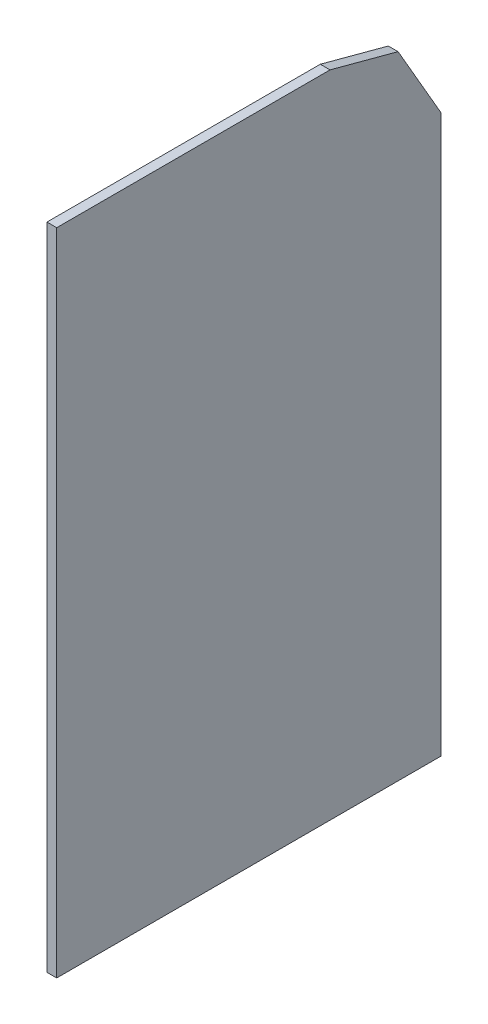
ISO-10303-21;
HEADER;
FILE_DESCRIPTION(('STEP AP214'),'2;1');
FILE_NAME('part.step','',(''),(''),'','','');
FILE_SCHEMA(('AUTOMOTIVE_DESIGN { 1 0 10303 214 1 1 1 1 }'));
ENDSEC;
DATA;
#1=APPLICATION_CONTEXT('core data for automotive mechanical design processes');
#2=APPLICATION_PROTOCOL_DEFINITION('international standard','automotive_design',2000,#1);
#3=PRODUCT_CONTEXT('',#1,'mechanical');
#4=PRODUCT('Part','Part','',(#3));
#5=PRODUCT_RELATED_PRODUCT_CATEGORY('part','',(#4));
#6=PRODUCT_DEFINITION_FORMATION('','',#4);
#7=PRODUCT_DEFINITION_CONTEXT('part definition',#1,'design');
#8=PRODUCT_DEFINITION('design','',#6,#7);
#9=PRODUCT_DEFINITION_SHAPE('','',#8);
#10=(LENGTH_UNIT() NAMED_UNIT(*) SI_UNIT(.MILLI.,.METRE.));
#11=(NAMED_UNIT(*) PLANE_ANGLE_UNIT() SI_UNIT($,.RADIAN.));
#12=(NAMED_UNIT(*) SI_UNIT($,.STERADIAN.) SOLID_ANGLE_UNIT());
#13=UNCERTAINTY_MEASURE_WITH_UNIT(LENGTH_MEASURE(1.E-05),#10,'distance_accuracy_value','');
#14=(GEOMETRIC_REPRESENTATION_CONTEXT(3) GLOBAL_UNCERTAINTY_ASSIGNED_CONTEXT((#13)) GLOBAL_UNIT_ASSIGNED_CONTEXT((#10,
#11,#12)) REPRESENTATION_CONTEXT('',''));
#15=CARTESIAN_POINT('',(0.,0.,0.));
#16=DIRECTION('',(0.,0.,1.));
#17=DIRECTION('',(1.,0.,0.));
#18=AXIS2_PLACEMENT_3D('',#15,#16,#17);
#19=CARTESIAN_POINT('',(38.1000000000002,5101.6125,1500.));
#20=DIRECTION('',(-1.,0.,0.));
#21=DIRECTION('',(0.,0.,1.));
#22=AXIS2_PLACEMENT_3D('',#19,#20,#21);
#23=PLANE('',#22);
#24=DIRECTION('',(0.,-0.258819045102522,-0.965925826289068));
#25=VECTOR('',#24,1.);
#26=CARTESIAN_POINT('',(38.1000000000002,4959.30710999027,-1164.48593996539));
#27=LINE('',#26,#25);
#28=CARTESIAN_POINT('',(38.1000000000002,5101.6125,-633.394994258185));
#29=VERTEX_POINT('',#28);
#30=CARTESIAN_POINT('',(38.0999999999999,4959.30710999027,-1164.48593996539));
#31=VERTEX_POINT('',#30);
#32=EDGE_CURVE('E708',#29,#31,#27,.T.);
#33=ORIENTED_EDGE('',*,*,#32,.F.);
#34=DIRECTION('',(0.,0.,-1.));
#35=VECTOR('',#34,1.);
#36=CARTESIAN_POINT('',(38.1000000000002,5101.6125,1500.));
#37=LINE('',#36,#35);
#38=CARTESIAN_POINT('',(38.1000000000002,5101.6125,1500.));
#39=VERTEX_POINT('',#38);
#40=EDGE_CURVE('E818',#39,#29,#37,.T.);
#41=ORIENTED_EDGE('',*,*,#40,.F.);
#42=DIRECTION('',(0.,-1.,0.));
#43=VECTOR('',#42,1.);
#44=CARTESIAN_POINT('',(38.1000000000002,5101.6125,1500.));
#45=LINE('',#44,#43);
#46=CARTESIAN_POINT('',(38.1000000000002,30.0000000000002,1500.));
#47=VERTEX_POINT('',#46);
#48=EDGE_CURVE('E822',#39,#47,#45,.T.);
#49=ORIENTED_EDGE('',*,*,#48,.T.);
#50=DIRECTION('',(0.,0.,-1.));
#51=VECTOR('',#50,1.);
#52=CARTESIAN_POINT('',(38.1000000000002,30.0000000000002,1500.));
#53=LINE('',#52,#51);
#54=CARTESIAN_POINT('',(38.0999999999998,30.0000000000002,-1500.));
#55=VERTEX_POINT('',#54);
#56=EDGE_CURVE('E848',#47,#55,#53,.T.);
#57=ORIENTED_EDGE('',*,*,#56,.T.);
#58=DIRECTION('',(0.,-1.,0.));
#59=VECTOR('',#58,1.);
#60=CARTESIAN_POINT('',(38.0999999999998,5101.6125,-1500.));
#61=LINE('',#60,#59);
#62=CARTESIAN_POINT('',(38.1000000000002,4380.42971135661,-1500.));
#63=VERTEX_POINT('',#62);
#64=EDGE_CURVE('E789',#63,#55,#61,.T.);
#65=ORIENTED_EDGE('',*,*,#64,.F.);
#66=DIRECTION('',(0.,0.,-1.));
#67=VECTOR('',#66,1.);
#68=CARTESIAN_POINT('',(38.1000000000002,4380.42971135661,-1498.70096189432));
#69=LINE('',#68,#67);
#70=CARTESIAN_POINT('',(38.1000000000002,4380.42971135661,-1498.70096189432));
#71=VERTEX_POINT('',#70);
#72=EDGE_CURVE('E768',#71,#63,#69,.T.);
#73=ORIENTED_EDGE('',*,*,#72,.F.);
#74=DIRECTION('',(0.,-0.86602540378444,-0.499999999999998));
#75=VECTOR('',#74,1.);
#76=CARTESIAN_POINT('',(38.1000000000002,4380.42971135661,-1498.70096189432));
#77=LINE('',#76,#75);
#78=EDGE_CURVE('E778',#31,#71,#77,.T.);
#79=ORIENTED_EDGE('',*,*,#78,.F.);
#80=EDGE_LOOP('',(#33,#41,#49,#57,#65,#73,#79));
#81=FACE_BOUND('',#80,.T.);
#82=ADVANCED_FACE('F691',(#81),#23,.F.);
#83=CARTESIAN_POINT('',(-38.0999999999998,5101.6125,1500.));
#84=DIRECTION('',(1.,0.,0.));
#85=DIRECTION('',(0.,0.,-1.));
#86=AXIS2_PLACEMENT_3D('',#83,#84,#85);
#87=PLANE('',#86);
#88=DIRECTION('',(0.,0.,1.));
#89=VECTOR('',#88,1.);
#90=CARTESIAN_POINT('',(-38.0999999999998,5101.6125,1500.));
#91=LINE('',#90,#89);
#92=CARTESIAN_POINT('',(-38.1000000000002,5101.6125,-633.394994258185));
#93=VERTEX_POINT('',#92);
#94=CARTESIAN_POINT('',(-38.0999999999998,5101.6125,1500.));
#95=VERTEX_POINT('',#94);
#96=EDGE_CURVE('E806',#93,#95,#91,.T.);
#97=ORIENTED_EDGE('',*,*,#96,.F.);
#98=DIRECTION('',(0.,-0.258819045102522,-0.965925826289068));
#99=VECTOR('',#98,1.);
#100=CARTESIAN_POINT('',(-38.1000000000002,4959.30710999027,-1164.48593996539));
#101=LINE('',#100,#99);
#102=CARTESIAN_POINT('',(-38.1000000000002,4959.30710999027,-1164.48593996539));
#103=VERTEX_POINT('',#102);
#104=EDGE_CURVE('E790',#93,#103,#101,.T.);
#105=ORIENTED_EDGE('',*,*,#104,.T.);
#106=DIRECTION('',(0.,-0.86602540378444,-0.499999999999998));
#107=VECTOR('',#106,1.);
#108=CARTESIAN_POINT('',(-38.1000000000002,4380.42971135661,-1498.70096189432));
#109=LINE('',#108,#107);
#110=CARTESIAN_POINT('',(-38.1000000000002,4380.42971135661,-1498.70096189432));
#111=VERTEX_POINT('',#110);
#112=EDGE_CURVE('E794',#103,#111,#109,.T.);
#113=ORIENTED_EDGE('',*,*,#112,.T.);
#114=DIRECTION('',(0.,0.,-1.));
#115=VECTOR('',#114,1.);
#116=CARTESIAN_POINT('',(-38.1000000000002,4380.42971135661,-1498.70096189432));
#117=LINE('',#116,#115);
#118=CARTESIAN_POINT('',(-38.1000000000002,4380.42971135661,-1500.));
#119=VERTEX_POINT('',#118);
#120=EDGE_CURVE('E772',#111,#119,#117,.T.);
#121=ORIENTED_EDGE('',*,*,#120,.T.);
#122=DIRECTION('',(0.,-1.,0.));
#123=VECTOR('',#122,1.);
#124=CARTESIAN_POINT('',(-38.1000000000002,5101.6125,-1500.));
#125=LINE('',#124,#123);
#126=CARTESIAN_POINT('',(-38.1000000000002,30.0000000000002,-1500.));
#127=VERTEX_POINT('',#126);
#128=EDGE_CURVE('E720',#119,#127,#125,.T.);
#129=ORIENTED_EDGE('',*,*,#128,.T.);
#130=DIRECTION('',(0.,0.,1.));
#131=VECTOR('',#130,1.);
#132=CARTESIAN_POINT('',(-38.0999999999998,30.0000000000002,1500.));
#133=LINE('',#132,#131);
#134=CARTESIAN_POINT('',(-38.0999999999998,30.0000000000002,1500.));
#135=VERTEX_POINT('',#134);
#136=EDGE_CURVE('E12',#127,#135,#133,.T.);
#137=ORIENTED_EDGE('',*,*,#136,.T.);
#138=DIRECTION('',(0.,-1.,0.));
#139=VECTOR('',#138,1.);
#140=CARTESIAN_POINT('',(-38.0999999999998,5101.6125,1500.));
#141=LINE('',#140,#139);
#142=EDGE_CURVE('E828',#95,#135,#141,.T.);
#143=ORIENTED_EDGE('',*,*,#142,.F.);
#144=EDGE_LOOP('',(#97,#105,#113,#121,#129,#137,#143));
#145=FACE_BOUND('',#144,.T.);
#146=ADVANCED_FACE('F896',(#145),#87,.F.);
#147=CARTESIAN_POINT('',(38.1000000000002,5101.6125,1500.));
#148=DIRECTION('',(0.,0.,-1.));
#149=DIRECTION('',(-1.,0.,0.));
#150=AXIS2_PLACEMENT_3D('',#147,#148,#149);
#151=PLANE('',#150);
#152=ORIENTED_EDGE('',*,*,#142,.T.);
#153=DIRECTION('',(1.,0.,0.));
#154=VECTOR('',#153,1.);
#155=CARTESIAN_POINT('',(38.1000000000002,30.0000000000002,1500.));
#156=LINE('',#155,#154);
#157=EDGE_CURVE('E835',#135,#47,#156,.T.);
#158=ORIENTED_EDGE('',*,*,#157,.T.);
#159=ORIENTED_EDGE('',*,*,#48,.F.);
#160=DIRECTION('',(1.,0.,0.));
#161=VECTOR('',#160,1.);
#162=CARTESIAN_POINT('',(38.1000000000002,5101.6125,1500.));
#163=LINE('',#162,#161);
#164=EDGE_CURVE('E811',#95,#39,#163,.T.);
#165=ORIENTED_EDGE('',*,*,#164,.F.);
#166=EDGE_LOOP('',(#152,#158,#159,#165));
#167=FACE_BOUND('',#166,.T.);
#168=ADVANCED_FACE('F888',(#167),#151,.F.);
#169=CARTESIAN_POINT('',(38.0999999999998,5101.6125,-1500.));
#170=DIRECTION('',(0.,0.,1.));
#171=DIRECTION('',(1.,0.,0.));
#172=AXIS2_PLACEMENT_3D('',#169,#170,#171);
#173=PLANE('',#172);
#174=ORIENTED_EDGE('',*,*,#128,.F.);
#175=DIRECTION('',(1.,0.,0.));
#176=VECTOR('',#175,1.);
#177=CARTESIAN_POINT('',(-38.1000000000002,4380.42971135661,-1500.));
#178=LINE('',#177,#176);
#179=EDGE_CURVE('E777',#119,#63,#178,.T.);
#180=ORIENTED_EDGE('',*,*,#179,.T.);
#181=ORIENTED_EDGE('',*,*,#64,.T.);
#182=DIRECTION('',(-1.,0.,0.));
#183=VECTOR('',#182,1.);
#184=CARTESIAN_POINT('',(38.0999999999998,30.0000000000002,-1500.));
#185=LINE('',#184,#183);
#186=EDGE_CURVE('E705',#55,#127,#185,.T.);
#187=ORIENTED_EDGE('',*,*,#186,.T.);
#188=EDGE_LOOP('',(#174,#180,#181,#187));
#189=FACE_BOUND('',#188,.T.);
#190=ADVANCED_FACE('F919',(#189),#173,.F.);
#191=CARTESIAN_POINT('',(0.,5101.6125,0.));
#192=DIRECTION('',(0.,1.,0.));
#193=DIRECTION('',(0.,0.,1.));
#194=AXIS2_PLACEMENT_3D('',#191,#192,#193);
#195=PLANE('',#194);
#196=DIRECTION('',(1.,0.,0.));
#197=VECTOR('',#196,1.);
#198=CARTESIAN_POINT('',(-38.1000000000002,5101.6125,-633.394994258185));
#199=LINE('',#198,#197);
#200=EDGE_CURVE('E805',#93,#29,#199,.T.);
#201=ORIENTED_EDGE('',*,*,#200,.F.);
#202=ORIENTED_EDGE('',*,*,#96,.T.);
#203=ORIENTED_EDGE('',*,*,#164,.T.);
#204=ORIENTED_EDGE('',*,*,#40,.T.);
#205=EDGE_LOOP('',(#201,#202,#203,#204));
#206=FACE_BOUND('',#205,.T.);
#207=ADVANCED_FACE('F892',(#206),#195,.T.);
#208=CARTESIAN_POINT('',(0.,0.,0.));
#209=DIRECTION('',(0.,1.,0.));
#210=DIRECTION('',(0.,0.,1.));
#211=AXIS2_PLACEMENT_3D('',#208,#209,#210);
#212=PLANE('',#211);
#213=DIRECTION('',(0.,0.,1.));
#214=VECTOR('',#213,1.);
#215=CARTESIAN_POINT('',(8.09999999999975,0.,0.));
#216=LINE('',#215,#214);
#217=CARTESIAN_POINT('',(8.09999999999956,0.,-1470.));
#218=VERTEX_POINT('',#217);
#219=CARTESIAN_POINT('',(8.09999999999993,0.,1470.));
#220=VERTEX_POINT('',#219);
#221=EDGE_CURVE('E845',#218,#220,#216,.T.);
#222=ORIENTED_EDGE('',*,*,#221,.T.);
#223=DIRECTION('',(-1.,0.,0.));
#224=VECTOR('',#223,1.);
#225=CARTESIAN_POINT('',(0.,0.,1470.));
#226=LINE('',#225,#224);
#227=CARTESIAN_POINT('',(-8.09999999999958,0.,1470.));
#228=VERTEX_POINT('',#227);
#229=EDGE_CURVE('E843',#220,#228,#226,.T.);
#230=ORIENTED_EDGE('',*,*,#229,.T.);
#231=DIRECTION('',(0.,0.,-1.));
#232=VECTOR('',#231,1.);
#233=CARTESIAN_POINT('',(-8.09999999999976,0.,0.));
#234=LINE('',#233,#232);
#235=CARTESIAN_POINT('',(-8.09999999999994,0.,-1470.));
#236=VERTEX_POINT('',#235);
#237=EDGE_CURVE('E837',#228,#236,#234,.T.);
#238=ORIENTED_EDGE('',*,*,#237,.T.);
#239=DIRECTION('',(1.,0.,0.));
#240=VECTOR('',#239,1.);
#241=CARTESIAN_POINT('',(0.,0.,-1470.));
#242=LINE('',#241,#240);
#243=EDGE_CURVE('E836',#236,#218,#242,.T.);
#244=ORIENTED_EDGE('',*,*,#243,.T.);
#245=EDGE_LOOP('',(#222,#230,#238,#244));
#246=FACE_BOUND('',#245,.T.);
#247=ADVANCED_FACE('F880',(#246),#212,.F.);
#248=CARTESIAN_POINT('',(38.0999999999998,30.0000000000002,-1500.));
#249=DIRECTION('',(0.,0.707106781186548,0.707106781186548));
#250=DIRECTION('',(-1.,0.,0.));
#251=AXIS2_PLACEMENT_3D('',#248,#249,#250);
#252=PLANE('',#251);
#253=DIRECTION('',(-0.577350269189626,-0.577350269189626,0.577350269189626));
#254=VECTOR('',#253,1.);
#255=CARTESIAN_POINT('',(38.0999999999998,30.0000000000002,-1500.));
#256=LINE('',#255,#254);
#257=EDGE_CURVE('E856',#218,#55,#256,.F.);
#258=ORIENTED_EDGE('',*,*,#257,.F.);
#259=ORIENTED_EDGE('',*,*,#243,.F.);
#260=DIRECTION('',(0.577350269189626,-0.577350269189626,0.577350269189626));
#261=VECTOR('',#260,1.);
#262=CARTESIAN_POINT('',(961.9,-970.,-500.));
#263=LINE('',#262,#261);
#264=EDGE_CURVE('E696',#127,#236,#263,.T.);
#265=ORIENTED_EDGE('',*,*,#264,.F.);
#266=ORIENTED_EDGE('',*,*,#186,.F.);
#267=EDGE_LOOP('',(#258,#259,#265,#266));
#268=FACE_BOUND('',#267,.T.);
#269=ADVANCED_FACE('F692',(#268),#252,.F.);
#270=CARTESIAN_POINT('',(-38.0999999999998,30.0000000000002,1500.));
#271=DIRECTION('',(0.707106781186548,0.707106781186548,0.));
#272=DIRECTION('',(0.,0.,1.));
#273=AXIS2_PLACEMENT_3D('',#270,#271,#272);
#274=PLANE('',#273);
#275=ORIENTED_EDGE('',*,*,#264,.T.);
#276=ORIENTED_EDGE('',*,*,#237,.F.);
#277=DIRECTION('',(-0.577350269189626,0.577350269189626,0.577350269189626));
#278=VECTOR('',#277,1.);
#279=CARTESIAN_POINT('',(-38.0999999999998,30.0000000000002,1500.));
#280=LINE('',#279,#278);
#281=EDGE_CURVE('E857',#135,#228,#280,.F.);
#282=ORIENTED_EDGE('',*,*,#281,.F.);
#283=ORIENTED_EDGE('',*,*,#136,.F.);
#284=EDGE_LOOP('',(#275,#276,#282,#283));
#285=FACE_BOUND('',#284,.T.);
#286=ADVANCED_FACE('F872',(#285),#274,.F.);
#287=CARTESIAN_POINT('',(38.1000000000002,30.0000000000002,1500.));
#288=DIRECTION('',(-0.707106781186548,0.707106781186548,0.));
#289=DIRECTION('',(0.,0.,-1.));
#290=AXIS2_PLACEMENT_3D('',#287,#288,#289);
#291=PLANE('',#290);
#292=ORIENTED_EDGE('',*,*,#257,.T.);
#293=ORIENTED_EDGE('',*,*,#56,.F.);
#294=DIRECTION('',(-0.577350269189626,-0.577350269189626,-0.577350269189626));
#295=VECTOR('',#294,1.);
#296=CARTESIAN_POINT('',(38.1000000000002,30.0000000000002,1500.));
#297=LINE('',#296,#295);
#298=EDGE_CURVE('E804',#220,#47,#297,.F.);
#299=ORIENTED_EDGE('',*,*,#298,.F.);
#300=ORIENTED_EDGE('',*,*,#221,.F.);
#301=EDGE_LOOP('',(#292,#293,#299,#300));
#302=FACE_BOUND('',#301,.T.);
#303=ADVANCED_FACE('F882',(#302),#291,.F.);
#304=CARTESIAN_POINT('',(38.1000000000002,30.0000000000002,1500.));
#305=DIRECTION('',(0.,0.707106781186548,-0.707106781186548));
#306=DIRECTION('',(1.,0.,0.));
#307=AXIS2_PLACEMENT_3D('',#304,#305,#306);
#308=PLANE('',#307);
#309=ORIENTED_EDGE('',*,*,#281,.T.);
#310=ORIENTED_EDGE('',*,*,#229,.F.);
#311=ORIENTED_EDGE('',*,*,#298,.T.);
#312=ORIENTED_EDGE('',*,*,#157,.F.);
#313=EDGE_LOOP('',(#309,#310,#311,#312));
#314=FACE_BOUND('',#313,.T.);
#315=ADVANCED_FACE('F881',(#314),#308,.F.);
#316=CARTESIAN_POINT('',(-38.1000000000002,4959.30710999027,-1164.48593996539));
#317=DIRECTION('',(0.,-0.965925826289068,0.258819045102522));
#318=DIRECTION('',(0.,-0.258819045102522,-0.965925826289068));
#319=AXIS2_PLACEMENT_3D('',#316,#317,#318);
#320=PLANE('',#319);
#321=DIRECTION('',(1.,0.,0.));
#322=VECTOR('',#321,1.);
#323=CARTESIAN_POINT('',(-38.1000000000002,4959.30710999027,-1164.48593996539));
#324=LINE('',#323,#322);
#325=EDGE_CURVE('E780',#103,#31,#324,.T.);
#326=ORIENTED_EDGE('',*,*,#325,.F.);
#327=ORIENTED_EDGE('',*,*,#104,.F.);
#328=ORIENTED_EDGE('',*,*,#200,.T.);
#329=ORIENTED_EDGE('',*,*,#32,.T.);
#330=EDGE_LOOP('',(#326,#327,#328,#329));
#331=FACE_BOUND('',#330,.T.);
#332=ADVANCED_FACE('F900',(#331),#320,.F.);
#333=CARTESIAN_POINT('',(-38.1000000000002,4380.42971135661,-1498.70096189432));
#334=DIRECTION('',(0.,-1.,0.));
#335=DIRECTION('',(0.,0.,-1.));
#336=AXIS2_PLACEMENT_3D('',#333,#334,#335);
#337=PLANE('',#336);
#338=ORIENTED_EDGE('',*,*,#179,.F.);
#339=ORIENTED_EDGE('',*,*,#120,.F.);
#340=DIRECTION('',(1.,0.,0.));
#341=VECTOR('',#340,1.);
#342=CARTESIAN_POINT('',(-38.1000000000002,4380.42971135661,-1498.70096189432));
#343=LINE('',#342,#341);
#344=EDGE_CURVE('E764',#111,#71,#343,.T.);
#345=ORIENTED_EDGE('',*,*,#344,.T.);
#346=ORIENTED_EDGE('',*,*,#72,.T.);
#347=EDGE_LOOP('',(#338,#339,#345,#346));
#348=FACE_BOUND('',#347,.T.);
#349=ADVANCED_FACE('F770',(#348),#337,.F.);
#350=CARTESIAN_POINT('',(-38.1000000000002,4380.42971135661,-1498.70096189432));
#351=DIRECTION('',(0.,-0.499999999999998,0.86602540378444));
#352=DIRECTION('',(0.,-0.86602540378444,-0.499999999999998));
#353=AXIS2_PLACEMENT_3D('',#350,#351,#352);
#354=PLANE('',#353);
#355=ORIENTED_EDGE('',*,*,#344,.F.);
#356=ORIENTED_EDGE('',*,*,#112,.F.);
#357=ORIENTED_EDGE('',*,*,#325,.T.);
#358=ORIENTED_EDGE('',*,*,#78,.T.);
#359=EDGE_LOOP('',(#355,#356,#357,#358));
#360=FACE_BOUND('',#359,.T.);
#361=ADVANCED_FACE('F781',(#360),#354,.F.);
#362=CLOSED_SHELL('',(#82,#146,#168,#190,#207,#247,#269,#286,#303,#315,#332,#349,#361));
#363=MANIFOLD_SOLID_BREP('B2',#362);
#364=ADVANCED_BREP_SHAPE_REPRESENTATION('',(#18,#363),#14);
#365=SHAPE_DEFINITION_REPRESENTATION(#9,#364);
ENDSEC;
END-ISO-10303-21;
